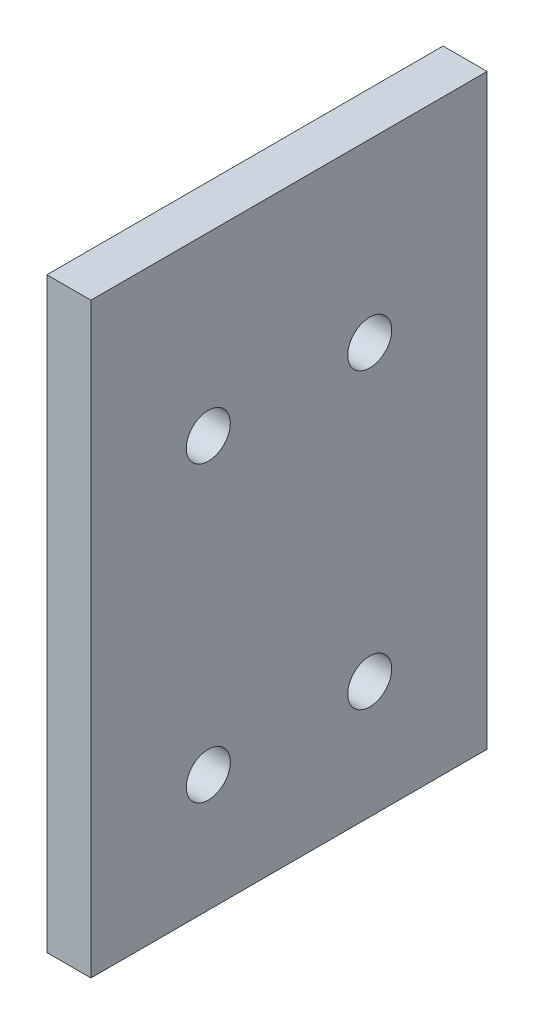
from build123d import *

# Parameters (mm, degrees)
SKETCH1_W           = 27
SKETCH1_H           = 40
SKETCH1_R           = 1.5
BOSS_EXTRUDE1_DEPTH = 3


with BuildPart() as part:
    # Sketch1 → Boss-Extrude1 (new body)
    with BuildSketch(Plane(origin=(0, 0, 0), x_dir=(0, 0, -1), z_dir=(1, 0, 0))):
        Rectangle(SKETCH1_W, SKETCH1_H)
        with Locations((-5.5, 8)):
            Circle(SKETCH1_R, mode=Mode.SUBTRACT)
        with Locations((5.5, 8)):
            Circle(SKETCH1_R, mode=Mode.SUBTRACT)
        with Locations((-5.5, -12)):
            Circle(SKETCH1_R, mode=Mode.SUBTRACT)
        with Locations((5.5, -12)):
            Circle(SKETCH1_R, mode=Mode.SUBTRACT)
    extrude(amount=BOSS_EXTRUDE1_DEPTH)


solid = part.part
